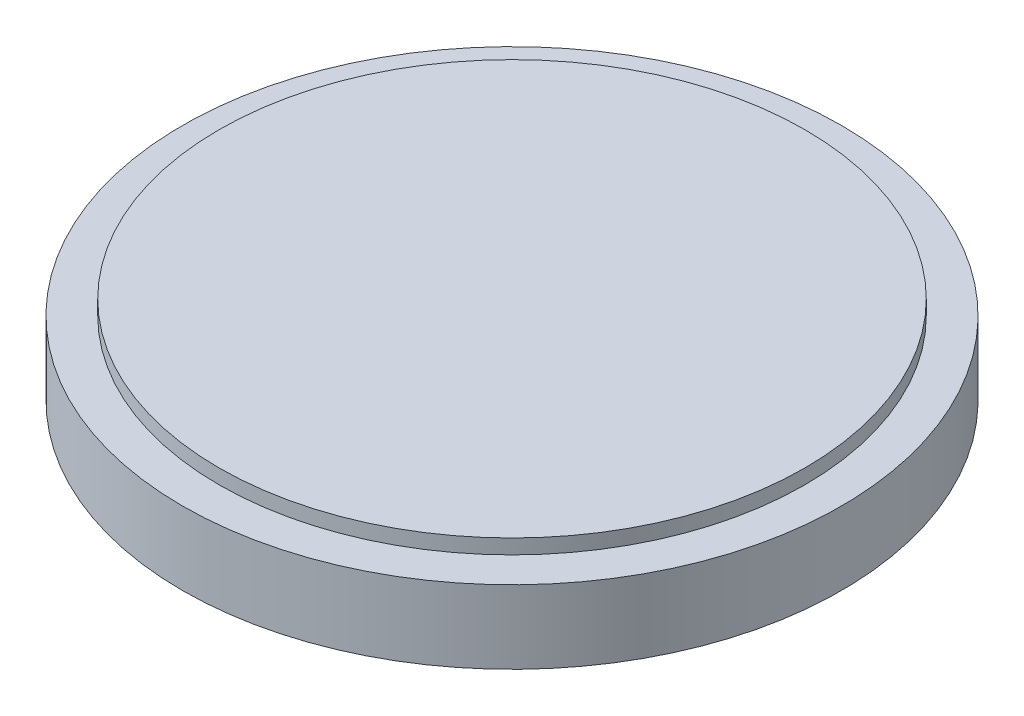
ISO-10303-21;
HEADER;
FILE_DESCRIPTION(('STEP AP214'),'2;1');
FILE_NAME('part.step','',(''),(''),'','','');
FILE_SCHEMA(('AUTOMOTIVE_DESIGN { 1 0 10303 214 1 1 1 1 }'));
ENDSEC;
DATA;
#1=APPLICATION_CONTEXT('core data for automotive mechanical design processes');
#2=APPLICATION_PROTOCOL_DEFINITION('international standard','automotive_design',2000,#1);
#3=PRODUCT_CONTEXT('',#1,'mechanical');
#4=PRODUCT('Part','Part','',(#3));
#5=PRODUCT_RELATED_PRODUCT_CATEGORY('part','',(#4));
#6=PRODUCT_DEFINITION_FORMATION('','',#4);
#7=PRODUCT_DEFINITION_CONTEXT('part definition',#1,'design');
#8=PRODUCT_DEFINITION('design','',#6,#7);
#9=PRODUCT_DEFINITION_SHAPE('','',#8);
#10=(LENGTH_UNIT() NAMED_UNIT(*) SI_UNIT(.MILLI.,.METRE.));
#11=(NAMED_UNIT(*) PLANE_ANGLE_UNIT() SI_UNIT($,.RADIAN.));
#12=(NAMED_UNIT(*) SI_UNIT($,.STERADIAN.) SOLID_ANGLE_UNIT());
#13=UNCERTAINTY_MEASURE_WITH_UNIT(LENGTH_MEASURE(1.E-05),#10,'distance_accuracy_value','');
#14=(GEOMETRIC_REPRESENTATION_CONTEXT(3) GLOBAL_UNCERTAINTY_ASSIGNED_CONTEXT((#13)) GLOBAL_UNIT_ASSIGNED_CONTEXT((#10,
#11,#12)) REPRESENTATION_CONTEXT('',''));
#15=CARTESIAN_POINT('',(0.,0.,0.));
#16=DIRECTION('',(0.,0.,1.));
#17=DIRECTION('',(1.,0.,0.));
#18=AXIS2_PLACEMENT_3D('',#15,#16,#17);
#19=CARTESIAN_POINT('',(0.,10.,0.));
#20=DIRECTION('',(0.,-1.,0.));
#21=DIRECTION('',(0.,0.,-1.));
#22=AXIS2_PLACEMENT_3D('',#19,#20,#21);
#23=CYLINDRICAL_SURFACE('',#22,45.);
#24=CARTESIAN_POINT('',(0.,10.,0.));
#25=DIRECTION('',(0.,1.,0.));
#26=DIRECTION('',(0.,0.,1.));
#27=AXIS2_PLACEMENT_3D('',#24,#25,#26);
#28=CIRCLE('',#27,45.);
#29=CARTESIAN_POINT('',(0.,10.,45.));
#30=VERTEX_POINT('',#29);
#31=EDGE_CURVE('E46',#30,#30,#28,.T.);
#32=ORIENTED_EDGE('',*,*,#31,.F.);
#33=EDGE_LOOP('',(#32));
#34=FACE_BOUND('',#33,.T.);
#35=CARTESIAN_POINT('',(0.,0.,0.));
#36=DIRECTION('',(0.,1.,0.));
#37=DIRECTION('',(0.,0.,1.));
#38=AXIS2_PLACEMENT_3D('',#35,#36,#37);
#39=CIRCLE('',#38,45.);
#40=CARTESIAN_POINT('',(0.,0.,45.));
#41=VERTEX_POINT('',#40);
#42=EDGE_CURVE('E42',#41,#41,#39,.T.);
#43=ORIENTED_EDGE('',*,*,#42,.T.);
#44=EDGE_LOOP('',(#43));
#45=FACE_BOUND('',#44,.T.);
#46=ADVANCED_FACE('F39',(#34,#45),#23,.T.);
#47=CARTESIAN_POINT('',(0.,10.,0.));
#48=DIRECTION('',(0.,1.,0.));
#49=DIRECTION('',(0.,0.,1.));
#50=AXIS2_PLACEMENT_3D('',#47,#48,#49);
#51=PLANE('',#50);
#52=CARTESIAN_POINT('',(0.,10.,0.));
#53=DIRECTION('',(0.,1.,0.));
#54=DIRECTION('',(0.,0.,1.));
#55=AXIS2_PLACEMENT_3D('',#52,#53,#54);
#56=CIRCLE('',#55,40.);
#57=CARTESIAN_POINT('',(0.,10.,40.));
#58=VERTEX_POINT('',#57);
#59=EDGE_CURVE('E10',#58,#58,#56,.T.);
#60=ORIENTED_EDGE('',*,*,#59,.F.);
#61=EDGE_LOOP('',(#60));
#62=FACE_BOUND('',#61,.T.);
#63=ORIENTED_EDGE('',*,*,#31,.T.);
#64=EDGE_LOOP('',(#63));
#65=FACE_BOUND('',#64,.T.);
#66=ADVANCED_FACE('F63',(#62,#65),#51,.T.);
#67=CARTESIAN_POINT('',(0.,0.,0.));
#68=DIRECTION('',(0.,1.,0.));
#69=DIRECTION('',(0.,0.,1.));
#70=AXIS2_PLACEMENT_3D('',#67,#68,#69);
#71=PLANE('',#70);
#72=ORIENTED_EDGE('',*,*,#42,.F.);
#73=EDGE_LOOP('',(#72));
#74=FACE_BOUND('',#73,.T.);
#75=ADVANCED_FACE('F60',(#74),#71,.F.);
#76=CARTESIAN_POINT('',(0.,12.,0.));
#77=DIRECTION('',(0.,-1.,0.));
#78=DIRECTION('',(0.,0.,-1.));
#79=AXIS2_PLACEMENT_3D('',#76,#77,#78);
#80=CYLINDRICAL_SURFACE('',#79,40.);
#81=CARTESIAN_POINT('',(0.,12.,0.));
#82=DIRECTION('',(0.,1.,0.));
#83=DIRECTION('',(0.,0.,1.));
#84=AXIS2_PLACEMENT_3D('',#81,#82,#83);
#85=CIRCLE('',#84,40.);
#86=CARTESIAN_POINT('',(0.,12.,40.));
#87=VERTEX_POINT('',#86);
#88=EDGE_CURVE('E52',#87,#87,#85,.T.);
#89=ORIENTED_EDGE('',*,*,#88,.F.);
#90=EDGE_LOOP('',(#89));
#91=FACE_BOUND('',#90,.T.);
#92=ORIENTED_EDGE('',*,*,#59,.T.);
#93=EDGE_LOOP('',(#92));
#94=FACE_BOUND('',#93,.T.);
#95=ADVANCED_FACE('F62',(#91,#94),#80,.T.);
#96=CARTESIAN_POINT('',(0.,12.,0.));
#97=DIRECTION('',(0.,1.,0.));
#98=DIRECTION('',(0.,0.,1.));
#99=AXIS2_PLACEMENT_3D('',#96,#97,#98);
#100=PLANE('',#99);
#101=ORIENTED_EDGE('',*,*,#88,.T.);
#102=EDGE_LOOP('',(#101));
#103=FACE_BOUND('',#102,.T.);
#104=ADVANCED_FACE('F69',(#103),#100,.T.);
#105=CLOSED_SHELL('',(#46,#66,#75,#95,#104));
#106=MANIFOLD_SOLID_BREP('B2',#105);
#107=ADVANCED_BREP_SHAPE_REPRESENTATION('',(#18,#106),#14);
#108=SHAPE_DEFINITION_REPRESENTATION(#9,#107);
ENDSEC;
END-ISO-10303-21;
